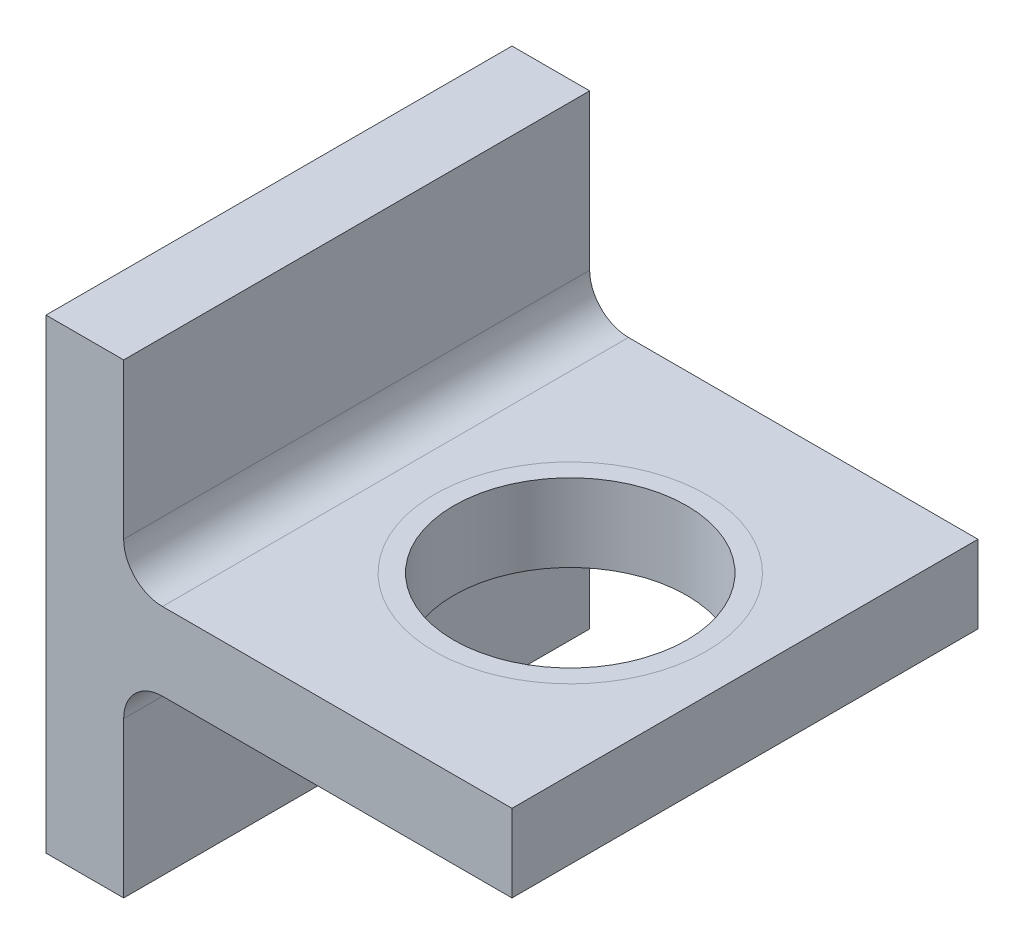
ISO-10303-21;
HEADER;
FILE_DESCRIPTION(('STEP AP214'),'2;1');
FILE_NAME('part.step','',(''),(''),'','','');
FILE_SCHEMA(('AUTOMOTIVE_DESIGN { 1 0 10303 214 1 1 1 1 }'));
ENDSEC;
DATA;
#1=APPLICATION_CONTEXT('core data for automotive mechanical design processes');
#2=APPLICATION_PROTOCOL_DEFINITION('international standard','automotive_design',2000,#1);
#3=PRODUCT_CONTEXT('',#1,'mechanical');
#4=PRODUCT('Part','Part','',(#3));
#5=PRODUCT_RELATED_PRODUCT_CATEGORY('part','',(#4));
#6=PRODUCT_DEFINITION_FORMATION('','',#4);
#7=PRODUCT_DEFINITION_CONTEXT('part definition',#1,'design');
#8=PRODUCT_DEFINITION('design','',#6,#7);
#9=PRODUCT_DEFINITION_SHAPE('','',#8);
#10=(LENGTH_UNIT() NAMED_UNIT(*) SI_UNIT(.MILLI.,.METRE.));
#11=(NAMED_UNIT(*) PLANE_ANGLE_UNIT() SI_UNIT($,.RADIAN.));
#12=(NAMED_UNIT(*) SI_UNIT($,.STERADIAN.) SOLID_ANGLE_UNIT());
#13=UNCERTAINTY_MEASURE_WITH_UNIT(LENGTH_MEASURE(1.E-05),#10,'distance_accuracy_value','');
#14=(GEOMETRIC_REPRESENTATION_CONTEXT(3) GLOBAL_UNCERTAINTY_ASSIGNED_CONTEXT((#13)) GLOBAL_UNIT_ASSIGNED_CONTEXT((#10,
#11,#12)) REPRESENTATION_CONTEXT('',''));
#15=CARTESIAN_POINT('',(0.,0.,0.));
#16=DIRECTION('',(0.,0.,1.));
#17=DIRECTION('',(1.,0.,0.));
#18=AXIS2_PLACEMENT_3D('',#15,#16,#17);
#19=CARTESIAN_POINT('',(20.,-10.,120.));
#20=DIRECTION('',(0.,1.,0.));
#21=DIRECTION('',(-1.,0.,0.));
#22=AXIS2_PLACEMENT_3D('',#19,#20,#21);
#23=PLANE('',#22);
#24=DIRECTION('',(1.,0.,0.));
#25=VECTOR('',#24,1.);
#26=CARTESIAN_POINT('',(20.,-10.,120.));
#27=LINE('',#26,#25);
#28=CARTESIAN_POINT('',(30.,-10.,120.));
#29=VERTEX_POINT('',#28);
#30=CARTESIAN_POINT('',(120.,-10.,120.));
#31=VERTEX_POINT('',#30);
#32=EDGE_CURVE('E172',#29,#31,#27,.T.);
#33=ORIENTED_EDGE('',*,*,#32,.F.);
#34=DIRECTION('',(0.,0.,-1.));
#35=VECTOR('',#34,1.);
#36=CARTESIAN_POINT('',(30.,-10.,0.));
#37=LINE('',#36,#35);
#38=CARTESIAN_POINT('',(30.,-10.,0.));
#39=VERTEX_POINT('',#38);
#40=EDGE_CURVE('E138',#29,#39,#37,.T.);
#41=ORIENTED_EDGE('',*,*,#40,.T.);
#42=DIRECTION('',(1.,0.,0.));
#43=VECTOR('',#42,1.);
#44=CARTESIAN_POINT('',(20.,-10.,0.));
#45=LINE('',#44,#43);
#46=CARTESIAN_POINT('',(120.,-10.,0.));
#47=VERTEX_POINT('',#46);
#48=EDGE_CURVE('E186',#39,#47,#45,.T.);
#49=ORIENTED_EDGE('',*,*,#48,.T.);
#50=DIRECTION('',(0.,0.,-1.));
#51=VECTOR('',#50,1.);
#52=CARTESIAN_POINT('',(120.,-10.,120.));
#53=LINE('',#52,#51);
#54=EDGE_CURVE('E143',#31,#47,#53,.T.);
#55=ORIENTED_EDGE('',*,*,#54,.F.);
#56=EDGE_LOOP('',(#33,#41,#49,#55));
#57=FACE_BOUND('',#56,.T.);
#58=CARTESIAN_POINT('',(75.,-10.,60.));
#59=DIRECTION('',(0.,1.,0.));
#60=DIRECTION('',(-1.,0.,0.));
#61=AXIS2_PLACEMENT_3D('',#58,#59,#60);
#62=CIRCLE('',#61,35.);
#63=CARTESIAN_POINT('',(40.,-10.,60.));
#64=VERTEX_POINT('',#63);
#65=EDGE_CURVE('E11',#64,#64,#62,.F.);
#66=ORIENTED_EDGE('',*,*,#65,.F.);
#67=EDGE_LOOP('',(#66));
#68=FACE_BOUND('',#67,.T.);
#69=ADVANCED_FACE('F32',(#57,#68),#23,.F.);
#70=CARTESIAN_POINT('',(20.,10.,120.));
#71=DIRECTION('',(0.,-1.,0.));
#72=DIRECTION('',(1.,0.,0.));
#73=AXIS2_PLACEMENT_3D('',#70,#71,#72);
#74=PLANE('',#73);
#75=DIRECTION('',(-1.,0.,0.));
#76=VECTOR('',#75,1.);
#77=CARTESIAN_POINT('',(20.,10.,0.));
#78=LINE('',#77,#76);
#79=CARTESIAN_POINT('',(120.,10.,0.));
#80=VERTEX_POINT('',#79);
#81=CARTESIAN_POINT('',(30.,10.,0.));
#82=VERTEX_POINT('',#81);
#83=EDGE_CURVE('E190',#80,#82,#78,.T.);
#84=ORIENTED_EDGE('',*,*,#83,.T.);
#85=DIRECTION('',(0.,0.,-1.));
#86=VECTOR('',#85,1.);
#87=CARTESIAN_POINT('',(30.,10.,120.));
#88=LINE('',#87,#86);
#89=CARTESIAN_POINT('',(30.,10.,120.));
#90=VERTEX_POINT('',#89);
#91=EDGE_CURVE('E48',#82,#90,#88,.F.);
#92=ORIENTED_EDGE('',*,*,#91,.T.);
#93=DIRECTION('',(-1.,0.,0.));
#94=VECTOR('',#93,1.);
#95=CARTESIAN_POINT('',(20.,10.,120.));
#96=LINE('',#95,#94);
#97=CARTESIAN_POINT('',(120.,10.,120.));
#98=VERTEX_POINT('',#97);
#99=EDGE_CURVE('E176',#98,#90,#96,.T.);
#100=ORIENTED_EDGE('',*,*,#99,.F.);
#101=DIRECTION('',(0.,0.,-1.));
#102=VECTOR('',#101,1.);
#103=CARTESIAN_POINT('',(120.,10.,120.));
#104=LINE('',#103,#102);
#105=EDGE_CURVE('E199',#98,#80,#104,.T.);
#106=ORIENTED_EDGE('',*,*,#105,.T.);
#107=EDGE_LOOP('',(#84,#92,#100,#106));
#108=FACE_BOUND('',#107,.T.);
#109=CARTESIAN_POINT('',(75.,10.,60.));
#110=DIRECTION('',(0.,-1.,0.));
#111=DIRECTION('',(1.,0.,0.));
#112=AXIS2_PLACEMENT_3D('',#109,#110,#111);
#113=CIRCLE('',#112,35.);
#114=CARTESIAN_POINT('',(110.,10.,60.));
#115=VERTEX_POINT('',#114);
#116=EDGE_CURVE('E36',#115,#115,#113,.F.);
#117=ORIENTED_EDGE('',*,*,#116,.F.);
#118=EDGE_LOOP('',(#117));
#119=FACE_BOUND('',#118,.T.);
#120=ADVANCED_FACE('F212',(#108,#119),#74,.F.);
#121=CARTESIAN_POINT('',(0.,-60.,120.));
#122=DIRECTION('',(1.,0.,0.));
#123=DIRECTION('',(0.,0.,-1.));
#124=AXIS2_PLACEMENT_3D('',#121,#122,#123);
#125=PLANE('',#124);
#126=DIRECTION('',(0.,-1.,0.));
#127=VECTOR('',#126,1.);
#128=CARTESIAN_POINT('',(0.,-60.,0.));
#129=LINE('',#128,#127);
#130=CARTESIAN_POINT('',(0.,60.,0.));
#131=VERTEX_POINT('',#130);
#132=CARTESIAN_POINT('',(0.,-60.,0.));
#133=VERTEX_POINT('',#132);
#134=EDGE_CURVE('E137',#131,#133,#129,.T.);
#135=ORIENTED_EDGE('',*,*,#134,.T.);
#136=DIRECTION('',(0.,0.,-1.));
#137=VECTOR('',#136,1.);
#138=CARTESIAN_POINT('',(0.,-60.,120.));
#139=LINE('',#138,#137);
#140=CARTESIAN_POINT('',(0.,-60.,120.));
#141=VERTEX_POINT('',#140);
#142=EDGE_CURVE('E116',#141,#133,#139,.T.);
#143=ORIENTED_EDGE('',*,*,#142,.F.);
#144=DIRECTION('',(0.,-1.,0.));
#145=VECTOR('',#144,1.);
#146=CARTESIAN_POINT('',(0.,-60.,120.));
#147=LINE('',#146,#145);
#148=CARTESIAN_POINT('',(0.,60.,120.));
#149=VERTEX_POINT('',#148);
#150=EDGE_CURVE('E124',#149,#141,#147,.T.);
#151=ORIENTED_EDGE('',*,*,#150,.F.);
#152=DIRECTION('',(0.,0.,-1.));
#153=VECTOR('',#152,1.);
#154=CARTESIAN_POINT('',(0.,60.,120.));
#155=LINE('',#154,#153);
#156=EDGE_CURVE('E180',#149,#131,#155,.T.);
#157=ORIENTED_EDGE('',*,*,#156,.T.);
#158=EDGE_LOOP('',(#135,#143,#151,#157));
#159=FACE_BOUND('',#158,.T.);
#160=ADVANCED_FACE('F135',(#159),#125,.F.);
#161=CARTESIAN_POINT('',(0.,-60.,120.));
#162=DIRECTION('',(0.,1.,0.));
#163=DIRECTION('',(-1.,0.,0.));
#164=AXIS2_PLACEMENT_3D('',#161,#162,#163);
#165=PLANE('',#164);
#166=DIRECTION('',(1.,0.,0.));
#167=VECTOR('',#166,1.);
#168=CARTESIAN_POINT('',(0.,-60.,0.));
#169=LINE('',#168,#167);
#170=CARTESIAN_POINT('',(20.,-60.,0.));
#171=VERTEX_POINT('',#170);
#172=EDGE_CURVE('E168',#133,#171,#169,.T.);
#173=ORIENTED_EDGE('',*,*,#172,.T.);
#174=DIRECTION('',(0.,0.,-1.));
#175=VECTOR('',#174,1.);
#176=CARTESIAN_POINT('',(20.,-60.,120.));
#177=LINE('',#176,#175);
#178=CARTESIAN_POINT('',(20.,-60.,120.));
#179=VERTEX_POINT('',#178);
#180=EDGE_CURVE('E119',#179,#171,#177,.T.);
#181=ORIENTED_EDGE('',*,*,#180,.F.);
#182=DIRECTION('',(1.,0.,0.));
#183=VECTOR('',#182,1.);
#184=CARTESIAN_POINT('',(0.,-60.,120.));
#185=LINE('',#184,#183);
#186=EDGE_CURVE('E112',#141,#179,#185,.T.);
#187=ORIENTED_EDGE('',*,*,#186,.F.);
#188=ORIENTED_EDGE('',*,*,#142,.T.);
#189=EDGE_LOOP('',(#173,#181,#187,#188));
#190=FACE_BOUND('',#189,.T.);
#191=ADVANCED_FACE('F114',(#190),#165,.F.);
#192=CARTESIAN_POINT('',(20.,-60.,120.));
#193=DIRECTION('',(-1.,0.,0.));
#194=DIRECTION('',(0.,-1.,0.));
#195=AXIS2_PLACEMENT_3D('',#192,#193,#194);
#196=PLANE('',#195);
#197=DIRECTION('',(0.,1.,0.));
#198=VECTOR('',#197,1.);
#199=CARTESIAN_POINT('',(20.,-60.,0.));
#200=LINE('',#199,#198);
#201=CARTESIAN_POINT('',(20.,-20.,0.));
#202=VERTEX_POINT('',#201);
#203=EDGE_CURVE('E183',#171,#202,#200,.T.);
#204=ORIENTED_EDGE('',*,*,#203,.T.);
#205=DIRECTION('',(0.,0.,-1.));
#206=VECTOR('',#205,1.);
#207=CARTESIAN_POINT('',(20.,-20.,120.));
#208=LINE('',#207,#206);
#209=CARTESIAN_POINT('',(20.,-20.,120.));
#210=VERTEX_POINT('',#209);
#211=EDGE_CURVE('E141',#202,#210,#208,.F.);
#212=ORIENTED_EDGE('',*,*,#211,.T.);
#213=DIRECTION('',(0.,1.,0.));
#214=VECTOR('',#213,1.);
#215=CARTESIAN_POINT('',(20.,-60.,120.));
#216=LINE('',#215,#214);
#217=EDGE_CURVE('E123',#179,#210,#216,.T.);
#218=ORIENTED_EDGE('',*,*,#217,.F.);
#219=ORIENTED_EDGE('',*,*,#180,.T.);
#220=EDGE_LOOP('',(#204,#212,#218,#219));
#221=FACE_BOUND('',#220,.T.);
#222=ADVANCED_FACE('F226',(#221),#196,.F.);
#223=ORIENTED_EDGE('',*,*,#65,.T.);
#224=EDGE_LOOP('',(#223));
#225=FACE_BOUND('',#224,.T.);
#226=CARTESIAN_POINT('',(75.,-10.,60.));
#227=DIRECTION('',(0.,1.,0.));
#228=DIRECTION('',(-1.,0.,0.));
#229=AXIS2_PLACEMENT_3D('',#226,#227,#228);
#230=CIRCLE('',#229,30.);
#231=CARTESIAN_POINT('',(75.,-10.,90.));
#232=VERTEX_POINT('',#231);
#233=EDGE_CURVE('E161',#232,#232,#230,.T.);
#234=ORIENTED_EDGE('',*,*,#233,.T.);
#235=EDGE_LOOP('',(#234));
#236=FACE_BOUND('',#235,.T.);
#237=ADVANCED_FACE('F235',(#225,#236),#23,.F.);
#238=CARTESIAN_POINT('',(120.,10.,120.));
#239=DIRECTION('',(-1.,0.,0.));
#240=DIRECTION('',(0.,0.,1.));
#241=AXIS2_PLACEMENT_3D('',#238,#239,#240);
#242=PLANE('',#241);
#243=DIRECTION('',(0.,1.,0.));
#244=VECTOR('',#243,1.);
#245=CARTESIAN_POINT('',(120.,10.,0.));
#246=LINE('',#245,#244);
#247=EDGE_CURVE('E188',#47,#80,#246,.T.);
#248=ORIENTED_EDGE('',*,*,#247,.T.);
#249=ORIENTED_EDGE('',*,*,#105,.F.);
#250=DIRECTION('',(0.,1.,0.));
#251=VECTOR('',#250,1.);
#252=CARTESIAN_POINT('',(120.,10.,120.));
#253=LINE('',#252,#251);
#254=EDGE_CURVE('E174',#31,#98,#253,.T.);
#255=ORIENTED_EDGE('',*,*,#254,.F.);
#256=ORIENTED_EDGE('',*,*,#54,.T.);
#257=EDGE_LOOP('',(#248,#249,#255,#256));
#258=FACE_BOUND('',#257,.T.);
#259=ADVANCED_FACE('F206',(#258),#242,.F.);
#260=ORIENTED_EDGE('',*,*,#116,.T.);
#261=EDGE_LOOP('',(#260));
#262=FACE_BOUND('',#261,.T.);
#263=CARTESIAN_POINT('',(75.,10.,60.));
#264=DIRECTION('',(0.,-1.,0.));
#265=DIRECTION('',(1.,0.,0.));
#266=AXIS2_PLACEMENT_3D('',#263,#264,#265);
#267=CIRCLE('',#266,30.);
#268=CARTESIAN_POINT('',(75.,10.,90.));
#269=VERTEX_POINT('',#268);
#270=EDGE_CURVE('E159',#269,#269,#267,.T.);
#271=ORIENTED_EDGE('',*,*,#270,.T.);
#272=EDGE_LOOP('',(#271));
#273=FACE_BOUND('',#272,.T.);
#274=ADVANCED_FACE('F243',(#262,#273),#74,.F.);
#275=CARTESIAN_POINT('',(20.,10.,120.));
#276=DIRECTION('',(-1.,0.,0.));
#277=DIRECTION('',(0.,-1.,0.));
#278=AXIS2_PLACEMENT_3D('',#275,#276,#277);
#279=PLANE('',#278);
#280=DIRECTION('',(0.,1.,0.));
#281=VECTOR('',#280,1.);
#282=CARTESIAN_POINT('',(20.,10.,120.));
#283=LINE('',#282,#281);
#284=CARTESIAN_POINT('',(20.,20.,120.));
#285=VERTEX_POINT('',#284);
#286=CARTESIAN_POINT('',(20.,60.,120.));
#287=VERTEX_POINT('',#286);
#288=EDGE_CURVE('E178',#285,#287,#283,.T.);
#289=ORIENTED_EDGE('',*,*,#288,.F.);
#290=DIRECTION('',(0.,0.,-1.));
#291=VECTOR('',#290,1.);
#292=CARTESIAN_POINT('',(20.,20.,0.));
#293=LINE('',#292,#291);
#294=CARTESIAN_POINT('',(20.,20.,0.));
#295=VERTEX_POINT('',#294);
#296=EDGE_CURVE('E148',#285,#295,#293,.T.);
#297=ORIENTED_EDGE('',*,*,#296,.T.);
#298=DIRECTION('',(0.,1.,0.));
#299=VECTOR('',#298,1.);
#300=CARTESIAN_POINT('',(20.,10.,0.));
#301=LINE('',#300,#299);
#302=CARTESIAN_POINT('',(20.,60.,0.));
#303=VERTEX_POINT('',#302);
#304=EDGE_CURVE('E192',#295,#303,#301,.T.);
#305=ORIENTED_EDGE('',*,*,#304,.T.);
#306=DIRECTION('',(0.,0.,-1.));
#307=VECTOR('',#306,1.);
#308=CARTESIAN_POINT('',(20.,60.,120.));
#309=LINE('',#308,#307);
#310=EDGE_CURVE('E196',#287,#303,#309,.T.);
#311=ORIENTED_EDGE('',*,*,#310,.F.);
#312=EDGE_LOOP('',(#289,#297,#305,#311));
#313=FACE_BOUND('',#312,.T.);
#314=ADVANCED_FACE('F220',(#313),#279,.F.);
#315=CARTESIAN_POINT('',(0.,60.,120.));
#316=DIRECTION('',(0.,-1.,0.));
#317=DIRECTION('',(0.,0.,-1.));
#318=AXIS2_PLACEMENT_3D('',#315,#316,#317);
#319=PLANE('',#318);
#320=DIRECTION('',(-1.,0.,0.));
#321=VECTOR('',#320,1.);
#322=CARTESIAN_POINT('',(0.,60.,0.));
#323=LINE('',#322,#321);
#324=EDGE_CURVE('E133',#303,#131,#323,.T.);
#325=ORIENTED_EDGE('',*,*,#324,.T.);
#326=ORIENTED_EDGE('',*,*,#156,.F.);
#327=DIRECTION('',(-1.,0.,0.));
#328=VECTOR('',#327,1.);
#329=CARTESIAN_POINT('',(0.,60.,120.));
#330=LINE('',#329,#328);
#331=EDGE_CURVE('E129',#287,#149,#330,.T.);
#332=ORIENTED_EDGE('',*,*,#331,.F.);
#333=ORIENTED_EDGE('',*,*,#310,.T.);
#334=EDGE_LOOP('',(#325,#326,#332,#333));
#335=FACE_BOUND('',#334,.T.);
#336=ADVANCED_FACE('F223',(#335),#319,.F.);
#337=CARTESIAN_POINT('',(0.,60.,120.));
#338=DIRECTION('',(0.,0.,-1.));
#339=DIRECTION('',(-1.,0.,0.));
#340=AXIS2_PLACEMENT_3D('',#337,#338,#339);
#341=PLANE('',#340);
#342=ORIENTED_EDGE('',*,*,#150,.T.);
#343=ORIENTED_EDGE('',*,*,#186,.T.);
#344=ORIENTED_EDGE('',*,*,#217,.T.);
#345=CARTESIAN_POINT('',(30.,-20.,120.));
#346=DIRECTION('',(0.,0.,-1.));
#347=DIRECTION('',(-1.,0.,0.));
#348=AXIS2_PLACEMENT_3D('',#345,#346,#347);
#349=CIRCLE('',#348,10.);
#350=EDGE_CURVE('E154',#210,#29,#349,.T.);
#351=ORIENTED_EDGE('',*,*,#350,.T.);
#352=ORIENTED_EDGE('',*,*,#32,.T.);
#353=ORIENTED_EDGE('',*,*,#254,.T.);
#354=ORIENTED_EDGE('',*,*,#99,.T.);
#355=CARTESIAN_POINT('',(30.,20.,120.));
#356=DIRECTION('',(0.,0.,-1.));
#357=DIRECTION('',(-1.,0.,0.));
#358=AXIS2_PLACEMENT_3D('',#355,#356,#357);
#359=CIRCLE('',#358,10.);
#360=EDGE_CURVE('E157',#90,#285,#359,.T.);
#361=ORIENTED_EDGE('',*,*,#360,.T.);
#362=ORIENTED_EDGE('',*,*,#288,.T.);
#363=ORIENTED_EDGE('',*,*,#331,.T.);
#364=EDGE_LOOP('',(#342,#343,#344,#351,#352,#353,#354,#361,#362,#363));
#365=FACE_BOUND('',#364,.T.);
#366=ADVANCED_FACE('F127',(#365),#341,.F.);
#367=CARTESIAN_POINT('',(0.,60.,0.));
#368=DIRECTION('',(0.,0.,-1.));
#369=DIRECTION('',(-1.,0.,0.));
#370=AXIS2_PLACEMENT_3D('',#367,#368,#369);
#371=PLANE('',#370);
#372=ORIENTED_EDGE('',*,*,#134,.F.);
#373=ORIENTED_EDGE('',*,*,#324,.F.);
#374=ORIENTED_EDGE('',*,*,#304,.F.);
#375=CARTESIAN_POINT('',(30.,20.,0.));
#376=DIRECTION('',(0.,0.,-1.));
#377=DIRECTION('',(-1.,0.,0.));
#378=AXIS2_PLACEMENT_3D('',#375,#376,#377);
#379=CIRCLE('',#378,10.);
#380=EDGE_CURVE('E56',#295,#82,#379,.F.);
#381=ORIENTED_EDGE('',*,*,#380,.T.);
#382=ORIENTED_EDGE('',*,*,#83,.F.);
#383=ORIENTED_EDGE('',*,*,#247,.F.);
#384=ORIENTED_EDGE('',*,*,#48,.F.);
#385=CARTESIAN_POINT('',(30.,-20.,0.));
#386=DIRECTION('',(0.,0.,-1.));
#387=DIRECTION('',(-1.,0.,0.));
#388=AXIS2_PLACEMENT_3D('',#385,#386,#387);
#389=CIRCLE('',#388,10.);
#390=EDGE_CURVE('E152',#39,#202,#389,.F.);
#391=ORIENTED_EDGE('',*,*,#390,.T.);
#392=ORIENTED_EDGE('',*,*,#203,.F.);
#393=ORIENTED_EDGE('',*,*,#172,.F.);
#394=EDGE_LOOP('',(#372,#373,#374,#381,#382,#383,#384,#391,#392,#393));
#395=FACE_BOUND('',#394,.T.);
#396=ADVANCED_FACE('F211',(#395),#371,.T.);
#397=CARTESIAN_POINT('',(30.,-20.,120.));
#398=DIRECTION('',(0.,0.,1.));
#399=DIRECTION('',(1.,0.,0.));
#400=AXIS2_PLACEMENT_3D('',#397,#398,#399);
#401=CYLINDRICAL_SURFACE('',#400,10.);
#402=ORIENTED_EDGE('',*,*,#350,.F.);
#403=ORIENTED_EDGE('',*,*,#211,.F.);
#404=ORIENTED_EDGE('',*,*,#390,.F.);
#405=ORIENTED_EDGE('',*,*,#40,.F.);
#406=EDGE_LOOP('',(#402,#403,#404,#405));
#407=FACE_BOUND('',#406,.T.);
#408=ADVANCED_FACE('F231',(#407),#401,.F.);
#409=CARTESIAN_POINT('',(30.,20.,120.));
#410=DIRECTION('',(0.,0.,1.));
#411=DIRECTION('',(1.,0.,0.));
#412=AXIS2_PLACEMENT_3D('',#409,#410,#411);
#413=CYLINDRICAL_SURFACE('',#412,10.);
#414=ORIENTED_EDGE('',*,*,#360,.F.);
#415=ORIENTED_EDGE('',*,*,#91,.F.);
#416=ORIENTED_EDGE('',*,*,#380,.F.);
#417=ORIENTED_EDGE('',*,*,#296,.F.);
#418=EDGE_LOOP('',(#414,#415,#416,#417));
#419=FACE_BOUND('',#418,.T.);
#420=ADVANCED_FACE('F34',(#419),#413,.F.);
#421=CARTESIAN_POINT('',(75.,-60.,60.));
#422=DIRECTION('',(0.,1.,0.));
#423=DIRECTION('',(0.,0.,1.));
#424=AXIS2_PLACEMENT_3D('',#421,#422,#423);
#425=CYLINDRICAL_SURFACE('',#424,30.);
#426=CARTESIAN_POINT('',(75.,10.,90.));
#427=CARTESIAN_POINT('',(75.,9.79166666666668,90.));
#428=CARTESIAN_POINT('',(75.,9.58333333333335,90.));
#429=CARTESIAN_POINT('',(75.,9.16666666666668,90.));
#430=CARTESIAN_POINT('',(75.,8.95833333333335,90.));
#431=CARTESIAN_POINT('',(75.,8.54166666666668,90.));
#432=CARTESIAN_POINT('',(75.,8.33333333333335,90.));
#433=CARTESIAN_POINT('',(75.,7.91666666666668,90.));
#434=CARTESIAN_POINT('',(75.,7.70833333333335,90.));
#435=CARTESIAN_POINT('',(75.,7.29166666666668,90.));
#436=CARTESIAN_POINT('',(75.,7.08333333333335,90.));
#437=CARTESIAN_POINT('',(75.,6.66666666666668,90.));
#438=CARTESIAN_POINT('',(75.,6.45833333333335,90.));
#439=CARTESIAN_POINT('',(75.,6.04166666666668,90.));
#440=CARTESIAN_POINT('',(75.,5.83333333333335,90.));
#441=CARTESIAN_POINT('',(75.,5.41666666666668,90.));
#442=CARTESIAN_POINT('',(75.,5.20833333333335,90.));
#443=CARTESIAN_POINT('',(75.,4.79166666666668,90.));
#444=CARTESIAN_POINT('',(75.,4.58333333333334,90.));
#445=CARTESIAN_POINT('',(75.,4.16666666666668,90.));
#446=CARTESIAN_POINT('',(75.,3.95833333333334,90.));
#447=CARTESIAN_POINT('',(75.,3.54166666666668,90.));
#448=CARTESIAN_POINT('',(75.,3.33333333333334,90.));
#449=CARTESIAN_POINT('',(75.,2.91666666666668,90.));
#450=CARTESIAN_POINT('',(75.,2.70833333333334,90.));
#451=CARTESIAN_POINT('',(75.,2.29166666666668,90.));
#452=CARTESIAN_POINT('',(75.,2.08333333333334,90.));
#453=CARTESIAN_POINT('',(75.,1.66666666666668,90.));
#454=CARTESIAN_POINT('',(75.,1.45833333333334,90.));
#455=CARTESIAN_POINT('',(75.,1.04166666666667,90.));
#456=CARTESIAN_POINT('',(75.,0.833333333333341,90.));
#457=CARTESIAN_POINT('',(75.,0.416666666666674,90.));
#458=CARTESIAN_POINT('',(75.,0.20833333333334,90.));
#459=CARTESIAN_POINT('',(75.,-0.208333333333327,90.));
#460=CARTESIAN_POINT('',(75.,-0.41666666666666,90.));
#461=CARTESIAN_POINT('',(75.,-0.833333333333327,90.));
#462=CARTESIAN_POINT('',(75.,-1.04166666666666,90.));
#463=CARTESIAN_POINT('',(75.,-1.45833333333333,90.));
#464=CARTESIAN_POINT('',(75.,-1.66666666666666,90.));
#465=CARTESIAN_POINT('',(75.,-2.08333333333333,90.));
#466=CARTESIAN_POINT('',(75.,-2.29166666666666,90.));
#467=CARTESIAN_POINT('',(75.,-2.70833333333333,90.));
#468=CARTESIAN_POINT('',(75.,-2.91666666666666,90.));
#469=CARTESIAN_POINT('',(75.,-3.33333333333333,90.));
#470=CARTESIAN_POINT('',(75.,-3.54166666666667,90.));
#471=CARTESIAN_POINT('',(75.,-3.95833333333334,90.));
#472=CARTESIAN_POINT('',(75.,-4.16666666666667,90.));
#473=CARTESIAN_POINT('',(75.,-4.58333333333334,90.));
#474=CARTESIAN_POINT('',(75.,-4.79166666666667,90.));
#475=CARTESIAN_POINT('',(75.,-5.20833333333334,90.));
#476=CARTESIAN_POINT('',(75.,-5.41666666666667,90.));
#477=CARTESIAN_POINT('',(75.,-5.83333333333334,90.));
#478=CARTESIAN_POINT('',(75.,-6.04166666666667,90.));
#479=CARTESIAN_POINT('',(75.,-6.45833333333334,90.));
#480=CARTESIAN_POINT('',(75.,-6.66666666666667,90.));
#481=CARTESIAN_POINT('',(75.,-7.08333333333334,90.));
#482=CARTESIAN_POINT('',(75.,-7.29166666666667,90.));
#483=CARTESIAN_POINT('',(75.,-7.70833333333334,90.));
#484=CARTESIAN_POINT('',(75.,-7.91666666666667,90.));
#485=CARTESIAN_POINT('',(75.,-8.33333333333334,90.));
#486=CARTESIAN_POINT('',(75.,-8.54166666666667,90.));
#487=CARTESIAN_POINT('',(75.,-8.95833333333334,90.));
#488=CARTESIAN_POINT('',(75.,-9.16666666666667,90.));
#489=CARTESIAN_POINT('',(75.,-9.58333333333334,90.));
#490=CARTESIAN_POINT('',(75.,-9.79166666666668,90.));
#491=CARTESIAN_POINT('',(75.,-10.,90.));
#492=B_SPLINE_CURVE_WITH_KNOTS('',3,(#426,#427,#428,#429,#430,#431,#432,#433,#434,#435,#436,
#437,#438,#439,#440,#441,#442,#443,#444,#445,#446,#447,#448,#449,#450,#451,#452,#453,#454,#455,
#456,#457,#458,#459,#460,#461,#462,#463,#464,#465,#466,#467,#468,#469,#470,#471,#472,#473,#474,
#475,#476,#477,#478,#479,#480,#481,#482,#483,#484,#485,#486,#487,#488,#489,#490,#491),
.UNSPECIFIED.,.F.,.F.,(4,2,2,2,2,2,2,2,2,2,2,2,2,2,2,2,2,2,2,2,2,2,2,2,2,2,2,2,2,2,2,2,4),(0.,
0.625000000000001,1.25,1.875,2.5,3.125,3.75,4.375,5.,5.62500000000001,6.25000000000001,
6.87500000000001,7.50000000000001,8.12500000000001,8.75000000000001,9.37500000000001,10.,10.625,
11.25,11.875,12.5,13.125,13.75,14.375,15.,15.625,16.25,16.875,17.5,18.125,18.75,19.375,20.),.UNSPECIFIED.);
#493=EDGE_CURVE('BSEAM256',#269,#232,#492,.T.);
#494=ORIENTED_EDGE('',*,*,#270,.F.);
#495=ORIENTED_EDGE('',*,*,#233,.F.);
#496=ORIENTED_EDGE('',*,*,#493,.T.);
#497=ORIENTED_EDGE('',*,*,#493,.F.);
#498=EDGE_LOOP('',(#494,#496,#495,#497));
#499=FACE_BOUND('',#498,.T.);
#500=ADVANCED_FACE('F256',(#499),#425,.F.);
#501=CLOSED_SHELL('',(#69,#120,#160,#191,#222,#237,#259,#274,#314,#336,#366,#396,#408,#420,#500));
#502=MANIFOLD_SOLID_BREP('B2',#501);
#503=ADVANCED_BREP_SHAPE_REPRESENTATION('',(#18,#502),#14);
#504=SHAPE_DEFINITION_REPRESENTATION(#9,#503);
ENDSEC;
END-ISO-10303-21;
